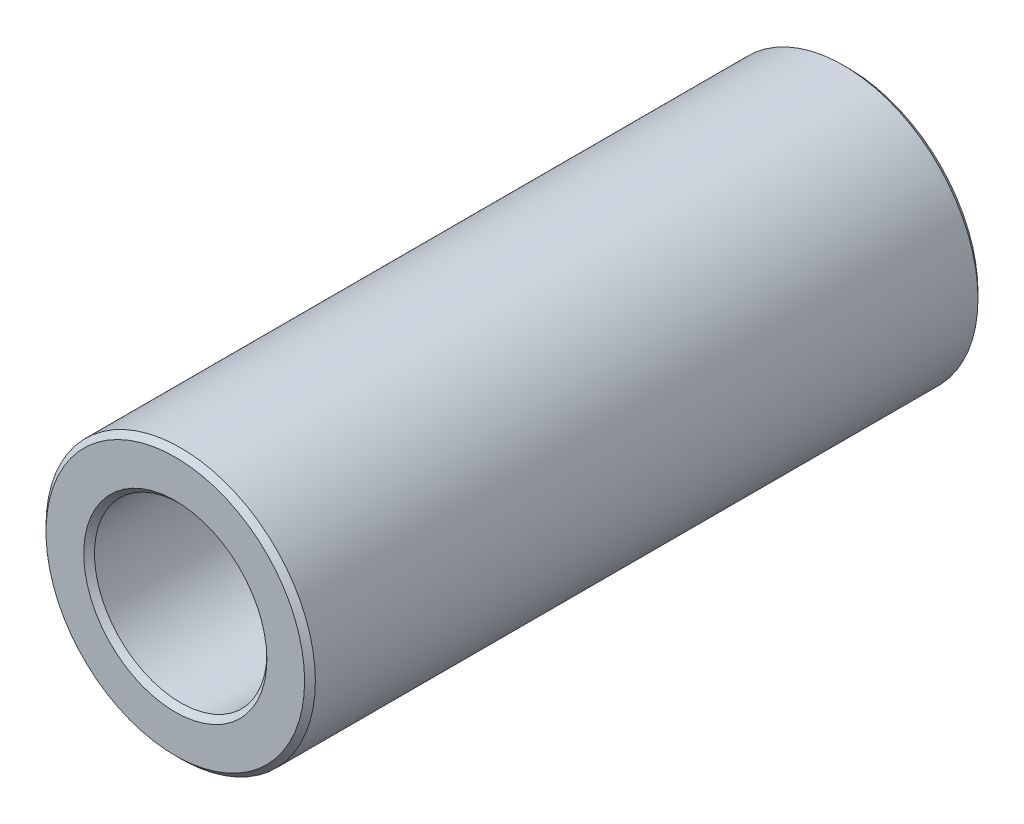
from build123d import *

# Parameters (mm, degrees)
SKETCH1_R           = 5
SKETCH1_R_2         = 3.2
BOSS_EXTRUDE2_DEPTH = 12.5
CHAMFER3_SIZE       = 0.2


with BuildPart() as part:
    # Sketch1 → Boss-Extrude2 (new, symmetric)
    with BuildSketch(Plane.XY):
        Circle(SKETCH1_R)
        Circle(SKETCH1_R_2, mode=Mode.SUBTRACT)
    extrude(amount=BOSS_EXTRUDE2_DEPTH, both=True)

    # Chamfer3
    chamfer3_edges = [part.edges().sort_by_distance(p)[0] for p in [
        (-5, 0, -12.5),
        (-5, 0, 12.5),
        (-3.2, 0, -12.5),
        (-3.2, 0, 12.5),
    ]]
    chamfer(chamfer3_edges, length=CHAMFER3_SIZE)


solid = part.part
